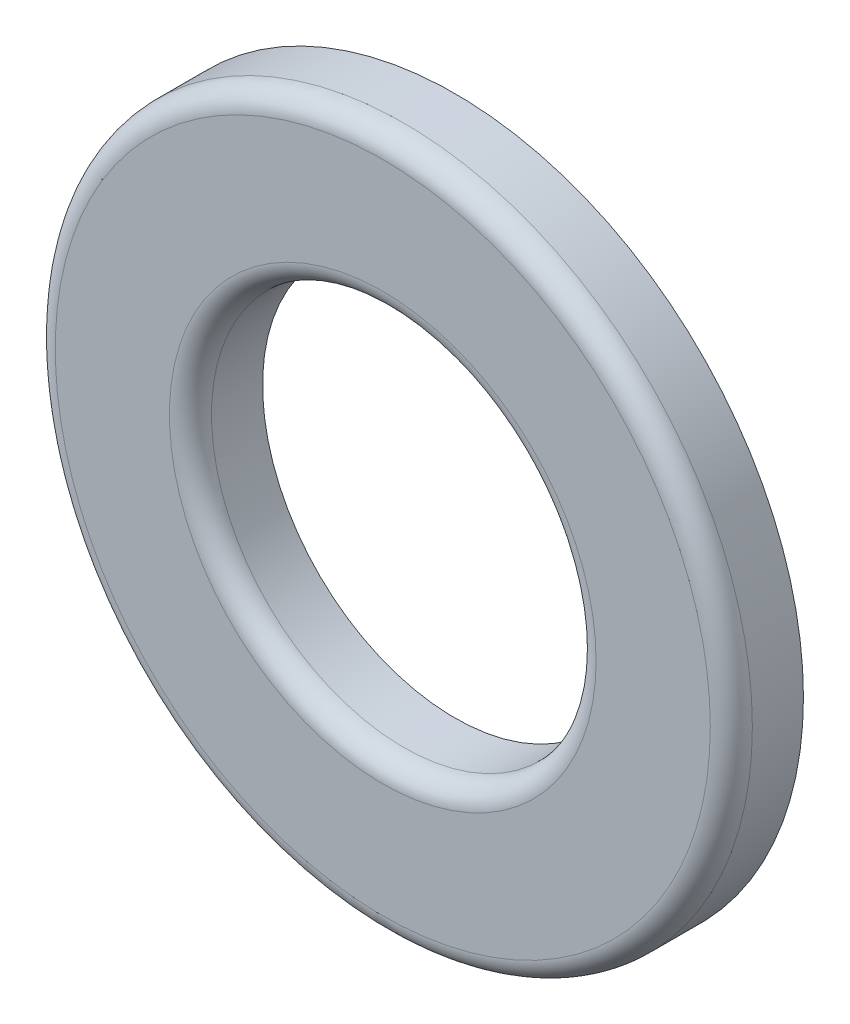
ISO-10303-21;
HEADER;
FILE_DESCRIPTION(('STEP AP214'),'2;1');
FILE_NAME('part.step','',(''),(''),'','','');
FILE_SCHEMA(('AUTOMOTIVE_DESIGN { 1 0 10303 214 1 1 1 1 }'));
ENDSEC;
DATA;
#1=APPLICATION_CONTEXT('core data for automotive mechanical design processes');
#2=APPLICATION_PROTOCOL_DEFINITION('international standard','automotive_design',2000,#1);
#3=PRODUCT_CONTEXT('',#1,'mechanical');
#4=PRODUCT('Part','Part','',(#3));
#5=PRODUCT_RELATED_PRODUCT_CATEGORY('part','',(#4));
#6=PRODUCT_DEFINITION_FORMATION('','',#4);
#7=PRODUCT_DEFINITION_CONTEXT('part definition',#1,'design');
#8=PRODUCT_DEFINITION('design','',#6,#7);
#9=PRODUCT_DEFINITION_SHAPE('','',#8);
#10=(LENGTH_UNIT() NAMED_UNIT(*) SI_UNIT(.MILLI.,.METRE.));
#11=(NAMED_UNIT(*) PLANE_ANGLE_UNIT() SI_UNIT($,.RADIAN.));
#12=(NAMED_UNIT(*) SI_UNIT($,.STERADIAN.) SOLID_ANGLE_UNIT());
#13=UNCERTAINTY_MEASURE_WITH_UNIT(LENGTH_MEASURE(1.E-05),#10,'distance_accuracy_value','');
#14=(GEOMETRIC_REPRESENTATION_CONTEXT(3) GLOBAL_UNCERTAINTY_ASSIGNED_CONTEXT((#13)) GLOBAL_UNIT_ASSIGNED_CONTEXT((#10,
#11,#12)) REPRESENTATION_CONTEXT('',''));
#15=CARTESIAN_POINT('',(0.,0.,0.));
#16=DIRECTION('',(0.,0.,1.));
#17=DIRECTION('',(1.,0.,0.));
#18=AXIS2_PLACEMENT_3D('',#15,#16,#17);
#19=CARTESIAN_POINT('',(0.,0.,1.20000000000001));
#20=DIRECTION('',(0.,0.,1.));
#21=DIRECTION('',(1.,0.,0.));
#22=AXIS2_PLACEMENT_3D('',#19,#20,#21);
#23=PLANE('',#22);
#24=CARTESIAN_POINT('',(0.,0.,1.20000000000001));
#25=DIRECTION('',(0.,0.,1.));
#26=DIRECTION('',(1.,0.,0.));
#27=AXIS2_PLACEMENT_3D('',#24,#25,#26);
#28=CIRCLE('',#27,3.55);
#29=CARTESIAN_POINT('',(3.55,0.,1.20000000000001));
#30=VERTEX_POINT('',#29);
#31=EDGE_CURVE('E33',#30,#30,#28,.F.);
#32=ORIENTED_EDGE('',*,*,#31,.T.);
#33=EDGE_LOOP('',(#32));
#34=FACE_BOUND('',#33,.T.);
#35=CARTESIAN_POINT('',(0.,0.,1.20000000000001));
#36=DIRECTION('',(0.,0.,1.));
#37=DIRECTION('',(1.,0.,0.));
#38=AXIS2_PLACEMENT_3D('',#35,#36,#37);
#39=CIRCLE('',#38,5.45);
#40=CARTESIAN_POINT('',(5.45,0.,1.20000000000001));
#41=VERTEX_POINT('',#40);
#42=EDGE_CURVE('E37',#41,#41,#39,.T.);
#43=ORIENTED_EDGE('',*,*,#42,.T.);
#44=EDGE_LOOP('',(#43));
#45=FACE_BOUND('',#44,.T.);
#46=ADVANCED_FACE('F26',(#34,#45),#23,.T.);
#47=CARTESIAN_POINT('',(0.,0.,0.));
#48=DIRECTION('',(0.,0.,1.));
#49=DIRECTION('',(1.,0.,0.));
#50=AXIS2_PLACEMENT_3D('',#47,#48,#49);
#51=PLANE('',#50);
#52=CARTESIAN_POINT('',(0.,0.,0.));
#53=DIRECTION('',(0.,0.,1.));
#54=DIRECTION('',(1.,0.,0.));
#55=AXIS2_PLACEMENT_3D('',#52,#53,#54);
#56=CIRCLE('',#55,5.8);
#57=CARTESIAN_POINT('',(5.8,0.,0.));
#58=VERTEX_POINT('',#57);
#59=EDGE_CURVE('E46',#58,#58,#56,.T.);
#60=ORIENTED_EDGE('',*,*,#59,.F.);
#61=EDGE_LOOP('',(#60));
#62=FACE_BOUND('',#61,.T.);
#63=CARTESIAN_POINT('',(0.,0.,0.));
#64=DIRECTION('',(0.,0.,1.));
#65=DIRECTION('',(1.,0.,0.));
#66=AXIS2_PLACEMENT_3D('',#63,#64,#65);
#67=CIRCLE('',#66,3.2);
#68=CARTESIAN_POINT('',(3.2,0.,0.));
#69=VERTEX_POINT('',#68);
#70=EDGE_CURVE('E49',#69,#69,#67,.T.);
#71=ORIENTED_EDGE('',*,*,#70,.T.);
#72=EDGE_LOOP('',(#71));
#73=FACE_BOUND('',#72,.T.);
#74=ADVANCED_FACE('F53',(#62,#73),#51,.F.);
#75=CARTESIAN_POINT('',(0.,0.,1.20000000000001));
#76=DIRECTION('',(0.,0.,-1.));
#77=DIRECTION('',(-1.,0.,0.));
#78=AXIS2_PLACEMENT_3D('',#75,#76,#77);
#79=CYLINDRICAL_SURFACE('',#78,5.8);
#80=CARTESIAN_POINT('',(0.,0.,0.84999999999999));
#81=DIRECTION('',(0.,0.,1.));
#82=DIRECTION('',(1.,0.,0.));
#83=AXIS2_PLACEMENT_3D('',#80,#81,#82);
#84=CIRCLE('',#83,5.8);
#85=CARTESIAN_POINT('',(5.8,0.,0.84999999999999));
#86=VERTEX_POINT('',#85);
#87=EDGE_CURVE('E10',#86,#86,#84,.F.);
#88=ORIENTED_EDGE('',*,*,#87,.T.);
#89=EDGE_LOOP('',(#88));
#90=FACE_BOUND('',#89,.T.);
#91=ORIENTED_EDGE('',*,*,#59,.T.);
#92=EDGE_LOOP('',(#91));
#93=FACE_BOUND('',#92,.T.);
#94=ADVANCED_FACE('F28',(#90,#93),#79,.T.);
#95=CARTESIAN_POINT('',(0.,0.,1.20000000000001));
#96=DIRECTION('',(0.,0.,-1.));
#97=DIRECTION('',(-1.,0.,0.));
#98=AXIS2_PLACEMENT_3D('',#95,#96,#97);
#99=CYLINDRICAL_SURFACE('',#98,3.2);
#100=CARTESIAN_POINT('',(0.,0.,0.84999999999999));
#101=DIRECTION('',(0.,0.,1.));
#102=DIRECTION('',(1.,0.,0.));
#103=AXIS2_PLACEMENT_3D('',#100,#101,#102);
#104=CIRCLE('',#103,3.2);
#105=CARTESIAN_POINT('',(3.2,0.,0.84999999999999));
#106=VERTEX_POINT('',#105);
#107=EDGE_CURVE('E41',#106,#106,#104,.T.);
#108=ORIENTED_EDGE('',*,*,#107,.T.);
#109=EDGE_LOOP('',(#108));
#110=FACE_BOUND('',#109,.T.);
#111=ORIENTED_EDGE('',*,*,#70,.F.);
#112=EDGE_LOOP('',(#111));
#113=FACE_BOUND('',#112,.T.);
#114=ADVANCED_FACE('F55',(#110,#113),#99,.F.);
#115=CARTESIAN_POINT('',(0.,0.,0.84999999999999));
#116=DIRECTION('',(0.,0.,1.));
#117=DIRECTION('',(1.,0.,0.));
#118=AXIS2_PLACEMENT_3D('',#115,#116,#117);
#119=TOROIDAL_SURFACE('',#118,3.55,0.35);
#120=ORIENTED_EDGE('',*,*,#31,.F.);
#121=EDGE_LOOP('',(#120));
#122=FACE_BOUND('',#121,.T.);
#123=ORIENTED_EDGE('',*,*,#107,.F.);
#124=EDGE_LOOP('',(#123));
#125=FACE_BOUND('',#124,.T.);
#126=ADVANCED_FACE('F57',(#122,#125),#119,.T.);
#127=CARTESIAN_POINT('',(0.,0.,0.84999999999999));
#128=DIRECTION('',(0.,0.,1.));
#129=DIRECTION('',(1.,0.,0.));
#130=AXIS2_PLACEMENT_3D('',#127,#128,#129);
#131=TOROIDAL_SURFACE('',#130,5.45,0.35);
#132=ORIENTED_EDGE('',*,*,#87,.F.);
#133=EDGE_LOOP('',(#132));
#134=FACE_BOUND('',#133,.T.);
#135=ORIENTED_EDGE('',*,*,#42,.F.);
#136=EDGE_LOOP('',(#135));
#137=FACE_BOUND('',#136,.T.);
#138=ADVANCED_FACE('F64',(#134,#137),#131,.T.);
#139=CLOSED_SHELL('',(#46,#74,#94,#114,#126,#138));
#140=MANIFOLD_SOLID_BREP('B2',#139);
#141=ADVANCED_BREP_SHAPE_REPRESENTATION('',(#18,#140),#14);
#142=SHAPE_DEFINITION_REPRESENTATION(#9,#141);
ENDSEC;
END-ISO-10303-21;
